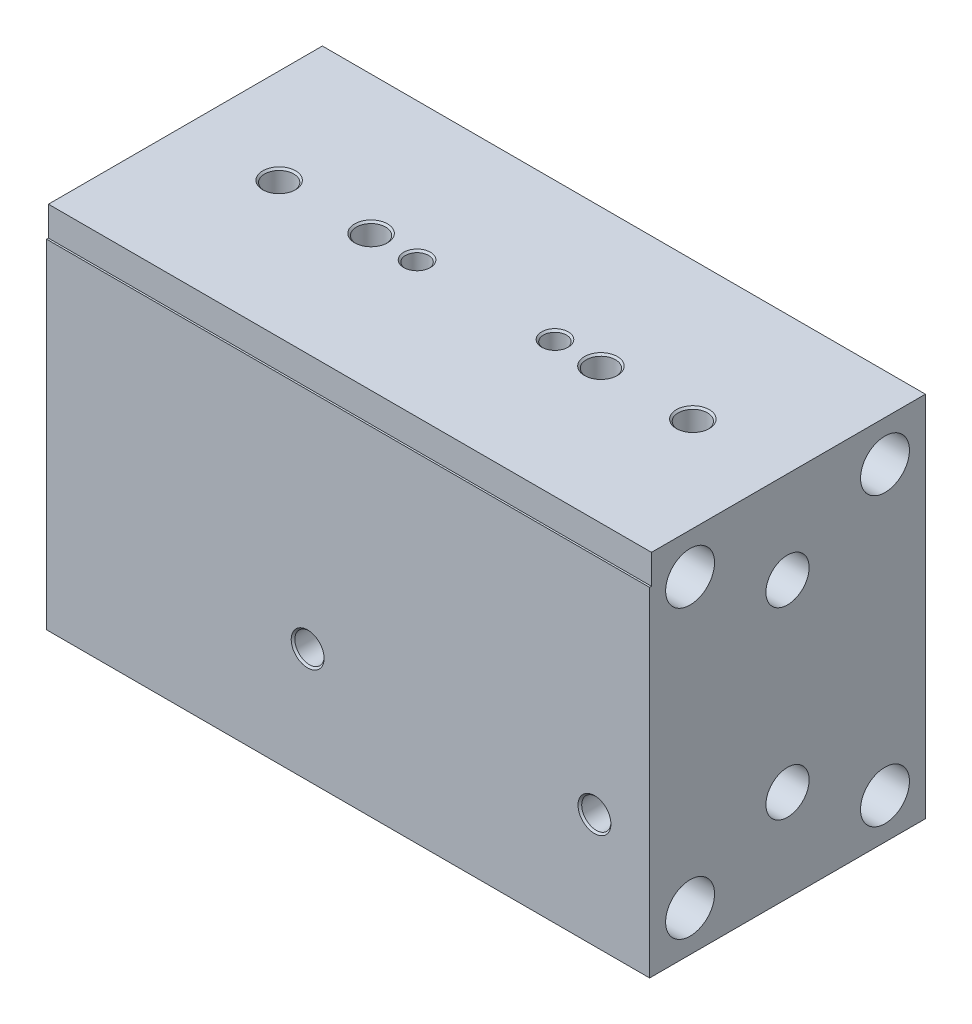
from build123d import *

# Parameters (mm, degrees)
SKETCH1_W                  = 83.312
SKETCH1_H                  = 50.8
EXTRUDE1_DEPTH             = 19.05
SKETCH18_W                 = 0.254
SKETCH18_H                 = 4.064
CUT_EXTRUDE1_DEPTH         = 90.15689454
F_10_32_TAPPED_HOLE2_D     = 4.0386
F_10_32_TAPPED_HOLE2_DEPTH = 10.3124
F_10_32_TAPPED_HOLE2_TIP   = 1.213317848
HOLE1_D                    = 3.175
HOLE1_DEPTH                = 6.35
HOLE1_TIP                  = 0.953866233
F_10_32_TAPPED_HOLE1_D     = 4.0386
F_10_32_TAPPED_HOLE1_DEPTH = 9.5504
F_10_32_TAPPED_HOLE1_TIP   = 1.213317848
F_8_32_TAPPED_HOLE2_D      = 3.4544
F_8_32_TAPPED_HOLE2_DEPTH  = 10.3124
F_8_32_TAPPED_HOLE2_TIP    = 1.037806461
HOLE2_D                    = 3.175
HOLE2_DEPTH                = 6.35
HOLE2_TIP                  = 0.953866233
CHAMFER1_SIZE              = 0.254
SKETCH29_R                 = 3.3782
SKETCH29_R_2               = 2.9845
CUT_EXTRUDE3_DEPTH         = 90.15689454


with BuildPart() as part:
    # Sketch1 → Extrude1 (new, symmetric)
    with BuildSketch(Plane.XY):
        Rectangle(SKETCH1_W, SKETCH1_H)
    extrude(amount=EXTRUDE1_DEPTH, both=True)

    # Sketch18 → Cut-Extrude1 (cut, through all)
    with BuildSketch(Plane(origin=(41.656, 0, 0), x_dir=(0, 0, -1), z_dir=(1, 0, 0))):
        with Locations((-18.923, 23.368)):
            Rectangle(SKETCH18_W, SKETCH18_H)
    extrude(amount=-CUT_EXTRUDE1_DEPTH, mode=Mode.SUBTRACT)

    # 10-32 Tapped Hole2
    with Locations(Plane(origin=(0, 25.4, 0), x_dir=(1, 0, 0), z_dir=(0, 1, 0))):
        with Locations((-15.875, 0), (15.875, 0), (-28.575, 0), (28.575, 0)):
            Hole(F_10_32_TAPPED_HOLE2_D / 2, depth=F_10_32_TAPPED_HOLE2_DEPTH)
            with Locations((0, 0, -(F_10_32_TAPPED_HOLE2_DEPTH + F_10_32_TAPPED_HOLE2_TIP / 2))):  # 118° drill point
                Cone(0, F_10_32_TAPPED_HOLE2_D / 2, F_10_32_TAPPED_HOLE2_TIP, mode=Mode.SUBTRACT)

    # Hole1
    with Locations(Plane(origin=(0, 25.4, 0), x_dir=(1, 0, 0), z_dir=(0, 1, 0))):
        with Locations((-9.525, 0), (9.525, 0)):
            Hole(HOLE1_D / 2, depth=HOLE1_DEPTH)
            with Locations((0, 0, -(HOLE1_DEPTH + HOLE1_TIP / 2))):  # 118° drill point
                Cone(0, HOLE1_D / 2, HOLE1_TIP, mode=Mode.SUBTRACT)

    # 10-32 Tapped Hole1
    with Locations(Plane.XY.offset(19.05)):
        with Locations((34.036, -9.652), (-5.588, -9.652)):
            Hole(F_10_32_TAPPED_HOLE1_D / 2, depth=F_10_32_TAPPED_HOLE1_DEPTH)
            with Locations((0, 0, -(F_10_32_TAPPED_HOLE1_DEPTH + F_10_32_TAPPED_HOLE1_TIP / 2))):  # 118° drill point
                Cone(0, F_10_32_TAPPED_HOLE1_D / 2, F_10_32_TAPPED_HOLE1_TIP, mode=Mode.SUBTRACT)

    # 8-32 Tapped Hole2
    with Locations(Plane(origin=(0, 0, -19.05), x_dir=(-1, 0, 0), z_dir=(0, 0, -1))):
        with Locations((-25.4, 7.9375), (25.4, 7.9375), (-25.4, -7.9375), (25.4, -7.9375)):
            Hole(F_8_32_TAPPED_HOLE2_D / 2, depth=F_8_32_TAPPED_HOLE2_DEPTH)
            with Locations((0, 0, -(F_8_32_TAPPED_HOLE2_DEPTH + F_8_32_TAPPED_HOLE2_TIP / 2))):  # 118° drill point
                Cone(0, F_8_32_TAPPED_HOLE2_D / 2, F_8_32_TAPPED_HOLE2_TIP, mode=Mode.SUBTRACT)

    # Hole2
    with Locations(Plane(origin=(0, 0, -19.05), x_dir=(-1, 0, 0), z_dir=(0, 0, -1))):
        with Locations((0, 7.9375), (0, -7.9375)):
            Hole(HOLE2_D / 2, depth=HOLE2_DEPTH)
            with Locations((0, 0, -(HOLE2_DEPTH + HOLE2_TIP / 2))):  # 118° drill point
                Cone(0, HOLE2_D / 2, HOLE2_TIP, mode=Mode.SUBTRACT)

    # Chamfer1
    chamfer1_edges = [part.edges().sort_by_distance(p)[0] for p in [
        (30.5943, 25.4, 0),
        (-26.5557, 25.4, 0),
        (17.8943, 25.4, 0),
        (-13.8557, 25.4, 0),
        (11.1125, 25.4, 0),
        (-7.9375, 25.4, 0),
        (-3.5687, -9.652, 19.05),
        (36.0553, -9.652, 19.05),
        (-27.1272, -7.9375, -19.05),
        (23.6728, -7.9375, -19.05),
        (-27.1272, 7.9375, -19.05),
        (23.6728, 7.9375, -19.05),
        (-1.5875, -7.9375, -19.05),
        (-1.5875, 7.9375, -19.05),
    ]]
    chamfer(chamfer1_edges, length=CHAMFER1_SIZE)

    # Sketch29 → Cut-Extrude3 (cut, through all)
    with BuildSketch(Plane(origin=(41.656, 0, 0), x_dir=(0, 0, -1), z_dir=(1, 0, 0))):
        with Locations((-13.462, 19.812)):
            Circle(SKETCH29_R)
        with Locations((13.462, 19.812)):
            Circle(SKETCH29_R)
        with Locations((-13.462, -19.812)):
            Circle(SKETCH29_R)
        with Locations((13.462, -19.812)):
            Circle(SKETCH29_R)
        with Locations((0, 12.7)):
            Circle(SKETCH29_R_2)
        with Locations((0, -12.7)):
            Circle(SKETCH29_R_2)
    extrude(amount=-CUT_EXTRUDE3_DEPTH, mode=Mode.SUBTRACT)


solid = part.part
